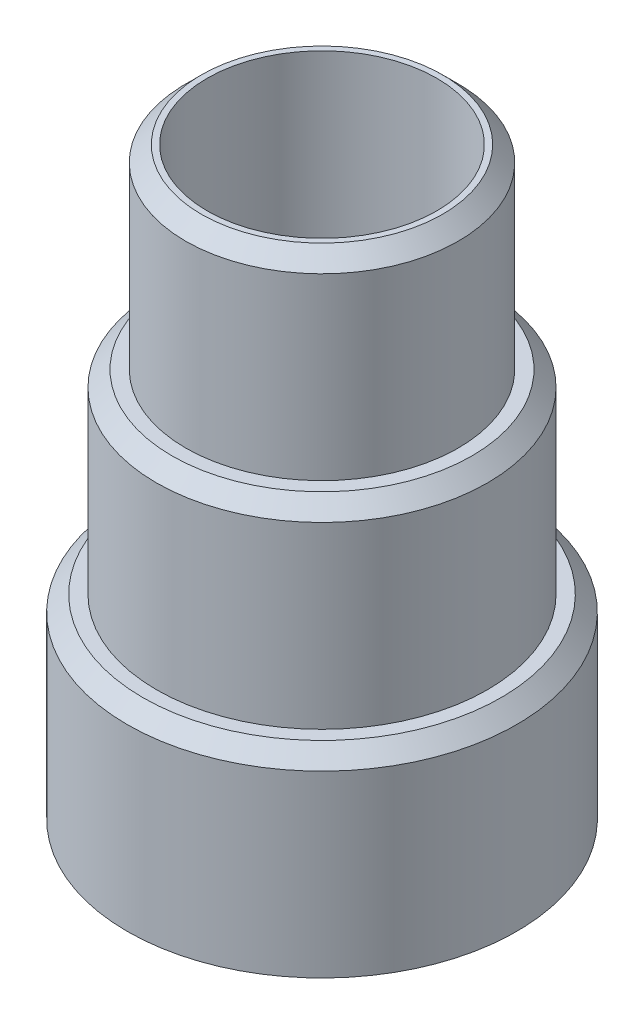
ISO-10303-21;
HEADER;
FILE_DESCRIPTION(('STEP AP214'),'2;1');
FILE_NAME('part.step','',(''),(''),'','','');
FILE_SCHEMA(('AUTOMOTIVE_DESIGN { 1 0 10303 214 1 1 1 1 }'));
ENDSEC;
DATA;
#1=APPLICATION_CONTEXT('core data for automotive mechanical design processes');
#2=APPLICATION_PROTOCOL_DEFINITION('international standard','automotive_design',2000,#1);
#3=PRODUCT_CONTEXT('',#1,'mechanical');
#4=PRODUCT('Part','Part','',(#3));
#5=PRODUCT_RELATED_PRODUCT_CATEGORY('part','',(#4));
#6=PRODUCT_DEFINITION_FORMATION('','',#4);
#7=PRODUCT_DEFINITION_CONTEXT('part definition',#1,'design');
#8=PRODUCT_DEFINITION('design','',#6,#7);
#9=PRODUCT_DEFINITION_SHAPE('','',#8);
#10=(LENGTH_UNIT() NAMED_UNIT(*) SI_UNIT(.MILLI.,.METRE.));
#11=(NAMED_UNIT(*) PLANE_ANGLE_UNIT() SI_UNIT($,.RADIAN.));
#12=(NAMED_UNIT(*) SI_UNIT($,.STERADIAN.) SOLID_ANGLE_UNIT());
#13=UNCERTAINTY_MEASURE_WITH_UNIT(LENGTH_MEASURE(1.E-05),#10,'distance_accuracy_value','');
#14=(GEOMETRIC_REPRESENTATION_CONTEXT(3) GLOBAL_UNCERTAINTY_ASSIGNED_CONTEXT((#13)) GLOBAL_UNIT_ASSIGNED_CONTEXT((#10,
#11,#12)) REPRESENTATION_CONTEXT('',''));
#15=CARTESIAN_POINT('',(0.,0.,0.));
#16=DIRECTION('',(0.,0.,1.));
#17=DIRECTION('',(1.,0.,0.));
#18=AXIS2_PLACEMENT_3D('',#15,#16,#17);
#19=CARTESIAN_POINT('',(0.,20.,0.));
#20=DIRECTION('',(0.,1.,0.));
#21=DIRECTION('',(0.,0.,1.));
#22=AXIS2_PLACEMENT_3D('',#19,#20,#21);
#23=PLANE('',#22);
#24=CARTESIAN_POINT('',(0.,20.,0.));
#25=DIRECTION('',(0.,1.,0.));
#26=DIRECTION('',(0.,0.,1.));
#27=AXIS2_PLACEMENT_3D('',#24,#25,#26);
#28=CIRCLE('',#27,7.7);
#29=CARTESIAN_POINT('',(0.,20.,7.7));
#30=VERTEX_POINT('',#29);
#31=EDGE_CURVE('E49',#30,#30,#28,.T.);
#32=ORIENTED_EDGE('',*,*,#31,.T.);
#33=EDGE_LOOP('',(#32));
#34=FACE_BOUND('',#33,.T.);
#35=CARTESIAN_POINT('',(0.,20.,0.));
#36=DIRECTION('',(0.,1.,0.));
#37=DIRECTION('',(0.,0.,1.));
#38=AXIS2_PLACEMENT_3D('',#35,#36,#37);
#39=CIRCLE('',#38,7.);
#40=CARTESIAN_POINT('',(0.,20.,7.));
#41=VERTEX_POINT('',#40);
#42=EDGE_CURVE('E71',#41,#41,#39,.T.);
#43=ORIENTED_EDGE('',*,*,#42,.F.);
#44=EDGE_LOOP('',(#43));
#45=FACE_BOUND('',#44,.T.);
#46=ADVANCED_FACE('F34',(#34,#45),#23,.T.);
#47=CARTESIAN_POINT('',(0.,10.,0.));
#48=DIRECTION('',(0.,1.,0.));
#49=DIRECTION('',(0.,0.,1.));
#50=AXIS2_PLACEMENT_3D('',#47,#48,#49);
#51=PLANE('',#50);
#52=CARTESIAN_POINT('',(0.,10.,0.));
#53=DIRECTION('',(0.,1.,0.));
#54=DIRECTION('',(0.,0.,1.));
#55=AXIS2_PLACEMENT_3D('',#52,#53,#54);
#56=CIRCLE('',#55,9.2);
#57=CARTESIAN_POINT('',(0.,10.,9.2));
#58=VERTEX_POINT('',#57);
#59=EDGE_CURVE('E41',#58,#58,#56,.T.);
#60=ORIENTED_EDGE('',*,*,#59,.T.);
#61=EDGE_LOOP('',(#60));
#62=FACE_BOUND('',#61,.T.);
#63=CARTESIAN_POINT('',(0.,10.,0.));
#64=DIRECTION('',(0.,1.,0.));
#65=DIRECTION('',(0.,0.,1.));
#66=AXIS2_PLACEMENT_3D('',#63,#64,#65);
#67=CIRCLE('',#66,8.5);
#68=CARTESIAN_POINT('',(0.,10.,8.5));
#69=VERTEX_POINT('',#68);
#70=EDGE_CURVE('E68',#69,#69,#67,.T.);
#71=ORIENTED_EDGE('',*,*,#70,.F.);
#72=EDGE_LOOP('',(#71));
#73=FACE_BOUND('',#72,.T.);
#74=ADVANCED_FACE('F115',(#62,#73),#51,.T.);
#75=CARTESIAN_POINT('',(0.,10.,0.));
#76=DIRECTION('',(0.,-1.,0.));
#77=DIRECTION('',(0.,0.,-1.));
#78=AXIS2_PLACEMENT_3D('',#75,#76,#77);
#79=CYLINDRICAL_SURFACE('',#78,10.);
#80=CARTESIAN_POINT('',(0.,9.19999999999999,0.));
#81=DIRECTION('',(0.,1.,0.));
#82=DIRECTION('',(0.,0.,1.));
#83=AXIS2_PLACEMENT_3D('',#80,#81,#82);
#84=CIRCLE('',#83,10.);
#85=CARTESIAN_POINT('',(0.,9.19999999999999,10.));
#86=VERTEX_POINT('',#85);
#87=EDGE_CURVE('E10',#86,#86,#84,.F.);
#88=ORIENTED_EDGE('',*,*,#87,.T.);
#89=EDGE_LOOP('',(#88));
#90=FACE_BOUND('',#89,.T.);
#91=CARTESIAN_POINT('',(0.,0.,0.));
#92=DIRECTION('',(0.,1.,0.));
#93=DIRECTION('',(0.,0.,1.));
#94=AXIS2_PLACEMENT_3D('',#91,#92,#93);
#95=CIRCLE('',#94,10.);
#96=CARTESIAN_POINT('',(0.,0.,10.));
#97=VERTEX_POINT('',#96);
#98=EDGE_CURVE('E60',#97,#97,#95,.T.);
#99=ORIENTED_EDGE('',*,*,#98,.T.);
#100=EDGE_LOOP('',(#99));
#101=FACE_BOUND('',#100,.T.);
#102=ADVANCED_FACE('F121',(#90,#101),#79,.T.);
#103=CARTESIAN_POINT('',(0.,0.,0.));
#104=DIRECTION('',(0.,1.,0.));
#105=DIRECTION('',(0.,0.,1.));
#106=AXIS2_PLACEMENT_3D('',#103,#104,#105);
#107=PLANE('',#106);
#108=CARTESIAN_POINT('',(0.,0.,0.));
#109=DIRECTION('',(0.,-1.,0.));
#110=DIRECTION('',(0.,0.,-1.));
#111=AXIS2_PLACEMENT_3D('',#108,#109,#110);
#112=CIRCLE('',#111,1.64999999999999);
#113=CARTESIAN_POINT('',(0.,0.,-1.64999999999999));
#114=VERTEX_POINT('',#113);
#115=EDGE_CURVE('E64',#114,#114,#112,.T.);
#116=ORIENTED_EDGE('',*,*,#115,.F.);
#117=EDGE_LOOP('',(#116));
#118=FACE_BOUND('',#117,.T.);
#119=ORIENTED_EDGE('',*,*,#98,.F.);
#120=EDGE_LOOP('',(#119));
#121=FACE_BOUND('',#120,.T.);
#122=ADVANCED_FACE('F126',(#118,#121),#107,.F.);
#123=CARTESIAN_POINT('',(0.,20.,0.));
#124=DIRECTION('',(0.,-1.,0.));
#125=DIRECTION('',(0.,0.,-1.));
#126=AXIS2_PLACEMENT_3D('',#123,#124,#125);
#127=CYLINDRICAL_SURFACE('',#126,8.5);
#128=CARTESIAN_POINT('',(0.,19.2,0.));
#129=DIRECTION('',(0.,1.,0.));
#130=DIRECTION('',(0.,0.,1.));
#131=AXIS2_PLACEMENT_3D('',#128,#129,#130);
#132=CIRCLE('',#131,8.5);
#133=CARTESIAN_POINT('',(0.,19.2,8.5));
#134=VERTEX_POINT('',#133);
#135=EDGE_CURVE('E45',#134,#134,#132,.F.);
#136=ORIENTED_EDGE('',*,*,#135,.T.);
#137=EDGE_LOOP('',(#136));
#138=FACE_BOUND('',#137,.T.);
#139=ORIENTED_EDGE('',*,*,#70,.T.);
#140=EDGE_LOOP('',(#139));
#141=FACE_BOUND('',#140,.T.);
#142=ADVANCED_FACE('F111',(#138,#141),#127,.T.);
#143=CARTESIAN_POINT('',(0.,30.,0.));
#144=DIRECTION('',(0.,-1.,0.));
#145=DIRECTION('',(0.,0.,-1.));
#146=AXIS2_PLACEMENT_3D('',#143,#144,#145);
#147=CYLINDRICAL_SURFACE('',#146,7.);
#148=CARTESIAN_POINT('',(0.,29.2,0.));
#149=DIRECTION('',(0.,1.,0.));
#150=DIRECTION('',(0.,0.,1.));
#151=AXIS2_PLACEMENT_3D('',#148,#149,#150);
#152=CIRCLE('',#151,7.);
#153=CARTESIAN_POINT('',(0.,29.2,7.));
#154=VERTEX_POINT('',#153);
#155=EDGE_CURVE('E54',#154,#154,#152,.F.);
#156=ORIENTED_EDGE('',*,*,#155,.T.);
#157=EDGE_LOOP('',(#156));
#158=FACE_BOUND('',#157,.T.);
#159=ORIENTED_EDGE('',*,*,#42,.T.);
#160=EDGE_LOOP('',(#159));
#161=FACE_BOUND('',#160,.T.);
#162=ADVANCED_FACE('F105',(#158,#161),#147,.T.);
#163=CARTESIAN_POINT('',(0.,30.,0.));
#164=DIRECTION('',(0.,1.,0.));
#165=DIRECTION('',(0.,0.,1.));
#166=AXIS2_PLACEMENT_3D('',#163,#164,#165);
#167=PLANE('',#166);
#168=CARTESIAN_POINT('',(0.,30.,0.));
#169=DIRECTION('',(0.,1.,0.));
#170=DIRECTION('',(0.,0.,1.));
#171=AXIS2_PLACEMENT_3D('',#168,#169,#170);
#172=CIRCLE('',#171,6.19999999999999);
#173=CARTESIAN_POINT('',(0.,30.,6.19999999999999));
#174=VERTEX_POINT('',#173);
#175=EDGE_CURVE('E57',#174,#174,#172,.T.);
#176=ORIENTED_EDGE('',*,*,#175,.T.);
#177=EDGE_LOOP('',(#176));
#178=FACE_BOUND('',#177,.T.);
#179=CARTESIAN_POINT('',(0.,30.,0.));
#180=DIRECTION('',(0.,1.,0.));
#181=DIRECTION('',(0.,0.,1.));
#182=AXIS2_PLACEMENT_3D('',#179,#180,#181);
#183=CIRCLE('',#182,5.9);
#184=CARTESIAN_POINT('',(0.,30.,5.9));
#185=VERTEX_POINT('',#184);
#186=EDGE_CURVE('E75',#185,#185,#183,.T.);
#187=ORIENTED_EDGE('',*,*,#186,.F.);
#188=EDGE_LOOP('',(#187));
#189=FACE_BOUND('',#188,.T.);
#190=ADVANCED_FACE('F100',(#178,#189),#167,.T.);
#191=CARTESIAN_POINT('',(0.,16.,0.));
#192=DIRECTION('',(0.,1.,0.));
#193=DIRECTION('',(0.,0.,1.));
#194=AXIS2_PLACEMENT_3D('',#191,#192,#193);
#195=CYLINDRICAL_SURFACE('',#194,5.9);
#196=CARTESIAN_POINT('',(0.,16.,0.));
#197=DIRECTION('',(0.,1.,0.));
#198=DIRECTION('',(0.,0.,1.));
#199=AXIS2_PLACEMENT_3D('',#196,#197,#198);
#200=CIRCLE('',#199,5.9);
#201=CARTESIAN_POINT('',(0.,16.,5.9));
#202=VERTEX_POINT('',#201);
#203=EDGE_CURVE('E74',#202,#202,#200,.T.);
#204=ORIENTED_EDGE('',*,*,#203,.F.);
#205=EDGE_LOOP('',(#204));
#206=FACE_BOUND('',#205,.T.);
#207=ORIENTED_EDGE('',*,*,#186,.T.);
#208=EDGE_LOOP('',(#207));
#209=FACE_BOUND('',#208,.T.);
#210=ADVANCED_FACE('F94',(#206,#209),#195,.F.);
#211=CARTESIAN_POINT('',(0.,16.,0.));
#212=DIRECTION('',(0.,1.,0.));
#213=DIRECTION('',(0.,0.,1.));
#214=AXIS2_PLACEMENT_3D('',#211,#212,#213);
#215=PLANE('',#214);
#216=CARTESIAN_POINT('',(0.,16.,0.));
#217=DIRECTION('',(0.,1.,0.));
#218=DIRECTION('',(0.,0.,1.));
#219=AXIS2_PLACEMENT_3D('',#216,#217,#218);
#220=CIRCLE('',#219,2.5);
#221=CARTESIAN_POINT('',(0.,16.,2.5));
#222=VERTEX_POINT('',#221);
#223=EDGE_CURVE('E84',#222,#222,#220,.T.);
#224=ORIENTED_EDGE('',*,*,#223,.F.);
#225=EDGE_LOOP('',(#224));
#226=FACE_BOUND('',#225,.T.);
#227=ORIENTED_EDGE('',*,*,#203,.T.);
#228=EDGE_LOOP('',(#227));
#229=FACE_BOUND('',#228,.T.);
#230=ADVANCED_FACE('F90',(#226,#229),#215,.T.);
#231=CARTESIAN_POINT('',(0.,0.,0.));
#232=DIRECTION('',(0.,-1.,0.));
#233=DIRECTION('',(0.,0.,-1.));
#234=AXIS2_PLACEMENT_3D('',#231,#232,#233);
#235=CYLINDRICAL_SURFACE('',#234,1.64999999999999);
#236=CARTESIAN_POINT('',(0.,6.48926847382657,0.));
#237=DIRECTION('',(0.,1.,0.));
#238=DIRECTION('',(0.,0.,1.));
#239=AXIS2_PLACEMENT_3D('',#236,#237,#238);
#240=CIRCLE('',#239,1.64999999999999);
#241=CARTESIAN_POINT('',(0.,6.48926847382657,1.64999999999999));
#242=VERTEX_POINT('',#241);
#243=EDGE_CURVE('E61',#242,#242,#240,.T.);
#244=ORIENTED_EDGE('',*,*,#243,.T.);
#245=EDGE_LOOP('',(#244));
#246=FACE_BOUND('',#245,.T.);
#247=ORIENTED_EDGE('',*,*,#115,.T.);
#248=EDGE_LOOP('',(#247));
#249=FACE_BOUND('',#248,.T.);
#250=ADVANCED_FACE('F93',(#246,#249),#235,.F.);
#251=CARTESIAN_POINT('',(0.,7.,0.));
#252=DIRECTION('',(0.,1.,0.));
#253=DIRECTION('',(0.,0.,1.));
#254=AXIS2_PLACEMENT_3D('',#251,#252,#253);
#255=CONICAL_SURFACE('',#254,2.5,1.02974425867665);
#256=CARTESIAN_POINT('',(0.,7.,0.));
#257=DIRECTION('',(0.,1.,0.));
#258=DIRECTION('',(0.,0.,1.));
#259=AXIS2_PLACEMENT_3D('',#256,#257,#258);
#260=CIRCLE('',#259,2.5);
#261=CARTESIAN_POINT('',(0.,7.,2.5));
#262=VERTEX_POINT('',#261);
#263=EDGE_CURVE('E65',#262,#262,#260,.T.);
#264=ORIENTED_EDGE('',*,*,#263,.T.);
#265=EDGE_LOOP('',(#264));
#266=FACE_BOUND('',#265,.T.);
#267=ORIENTED_EDGE('',*,*,#243,.F.);
#268=EDGE_LOOP('',(#267));
#269=FACE_BOUND('',#268,.T.);
#270=ADVANCED_FACE('F207',(#266,#269),#255,.F.);
#271=CARTESIAN_POINT('',(0.,16.,0.));
#272=DIRECTION('',(0.,1.,0.));
#273=DIRECTION('',(0.,0.,1.));
#274=AXIS2_PLACEMENT_3D('',#271,#272,#273);
#275=CYLINDRICAL_SURFACE('',#274,2.5);
#276=ORIENTED_EDGE('',*,*,#263,.F.);
#277=EDGE_LOOP('',(#276));
#278=FACE_BOUND('',#277,.T.);
#279=ORIENTED_EDGE('',*,*,#223,.T.);
#280=EDGE_LOOP('',(#279));
#281=FACE_BOUND('',#280,.T.);
#282=ADVANCED_FACE('F88',(#278,#281),#275,.F.);
#283=CARTESIAN_POINT('',(0.,30.,0.));
#284=DIRECTION('',(0.,-1.,0.));
#285=DIRECTION('',(0.,0.,-1.));
#286=AXIS2_PLACEMENT_3D('',#283,#284,#285);
#287=CONICAL_SURFACE('',#286,6.19999999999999,0.785398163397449);
#288=ORIENTED_EDGE('',*,*,#155,.F.);
#289=EDGE_LOOP('',(#288));
#290=FACE_BOUND('',#289,.T.);
#291=ORIENTED_EDGE('',*,*,#175,.F.);
#292=EDGE_LOOP('',(#291));
#293=FACE_BOUND('',#292,.T.);
#294=ADVANCED_FACE('F134',(#290,#293),#287,.T.);
#295=CARTESIAN_POINT('',(0.,20.,0.));
#296=DIRECTION('',(0.,-1.,0.));
#297=DIRECTION('',(0.,0.,-1.));
#298=AXIS2_PLACEMENT_3D('',#295,#296,#297);
#299=CONICAL_SURFACE('',#298,7.7,0.785398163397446);
#300=ORIENTED_EDGE('',*,*,#135,.F.);
#301=EDGE_LOOP('',(#300));
#302=FACE_BOUND('',#301,.T.);
#303=ORIENTED_EDGE('',*,*,#31,.F.);
#304=EDGE_LOOP('',(#303));
#305=FACE_BOUND('',#304,.T.);
#306=ADVANCED_FACE('F136',(#302,#305),#299,.T.);
#307=CARTESIAN_POINT('',(0.,10.,0.));
#308=DIRECTION('',(0.,-1.,0.));
#309=DIRECTION('',(0.,0.,-1.));
#310=AXIS2_PLACEMENT_3D('',#307,#308,#309);
#311=CONICAL_SURFACE('',#310,9.2,0.785398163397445);
#312=ORIENTED_EDGE('',*,*,#87,.F.);
#313=EDGE_LOOP('',(#312));
#314=FACE_BOUND('',#313,.T.);
#315=ORIENTED_EDGE('',*,*,#59,.F.);
#316=EDGE_LOOP('',(#315));
#317=FACE_BOUND('',#316,.T.);
#318=ADVANCED_FACE('F36',(#314,#317),#311,.T.);
#319=CLOSED_SHELL('',(#46,#74,#102,#122,#142,#162,#190,#210,#230,#250,#270,#282,#294,#306,#318));
#320=MANIFOLD_SOLID_BREP('B2',#319);
#321=ADVANCED_BREP_SHAPE_REPRESENTATION('',(#18,#320),#14);
#322=SHAPE_DEFINITION_REPRESENTATION(#9,#321);
ENDSEC;
END-ISO-10303-21;
